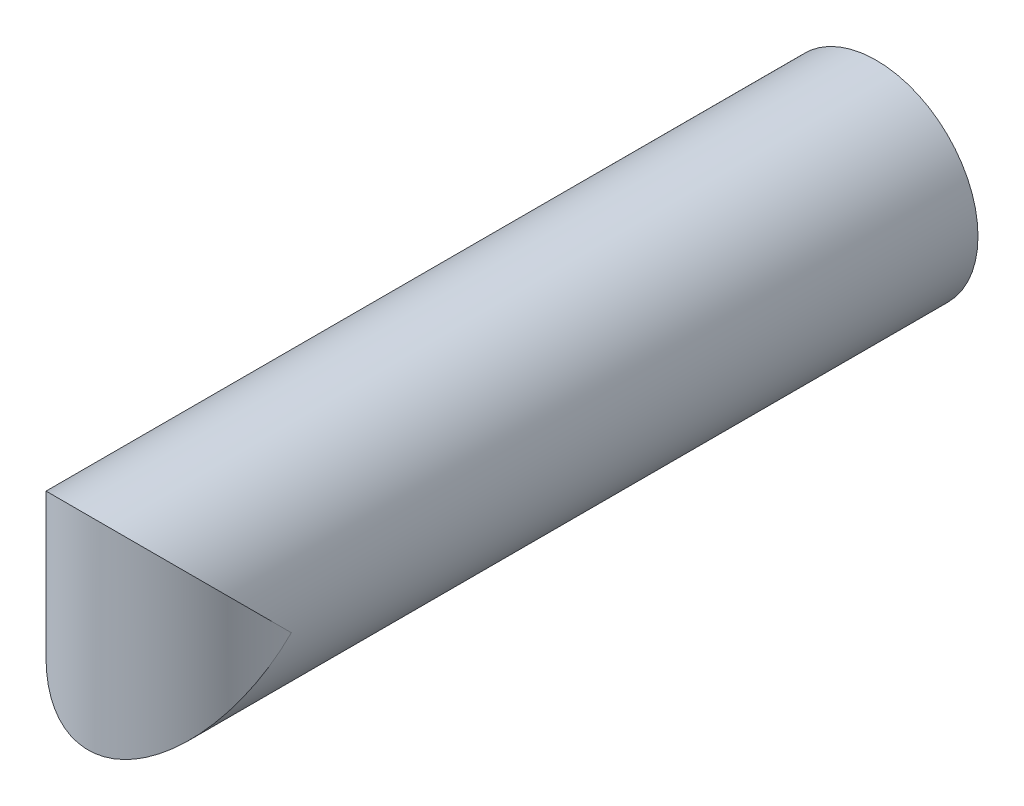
from build123d import *

# Parameters (mm, degrees)
ESQUISSE1_R                  = 2.05
EXTRUSION1_DEPTH             = 15.9
ENL_V_MAT_EXTRU_1_DEPTH      = 20
ENL_V_MAT_EXTRU_1_DEPTH_BACK = 20


with BuildPart() as part:
    # Esquisse1 → Extrusion1 (new body)
    with BuildSketch(Plane.XY):
        Circle(ESQUISSE1_R)
    extrude(amount=EXTRUSION1_DEPTH)

    # Esquisse2 → Enl_v. mat.-Extru.1 (cut, two sides: drawn at the far end of the back side and taken through both)
    with BuildSketch(Plane(origin=(0, 0, 0), x_dir=(1, 0, 0), z_dir=(0, 1, 0)).offset(-ENL_V_MAT_EXTRU_1_DEPTH_BACK)):
        with BuildLine():
            Line((-2.05, -13.85), (-2.05, -22.528430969))
            Line((-2.05, -22.528430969), (2.05, -22.528430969))
            Line((2.05, -22.528430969), (2.05, -13.85))
            ThreePointArc((2.05, -13.85), (0, -15.9), (-2.05, -13.85))
        make_face()
    extrude(amount=ENL_V_MAT_EXTRU_1_DEPTH + ENL_V_MAT_EXTRU_1_DEPTH_BACK, mode=Mode.SUBTRACT)


solid = part.part
